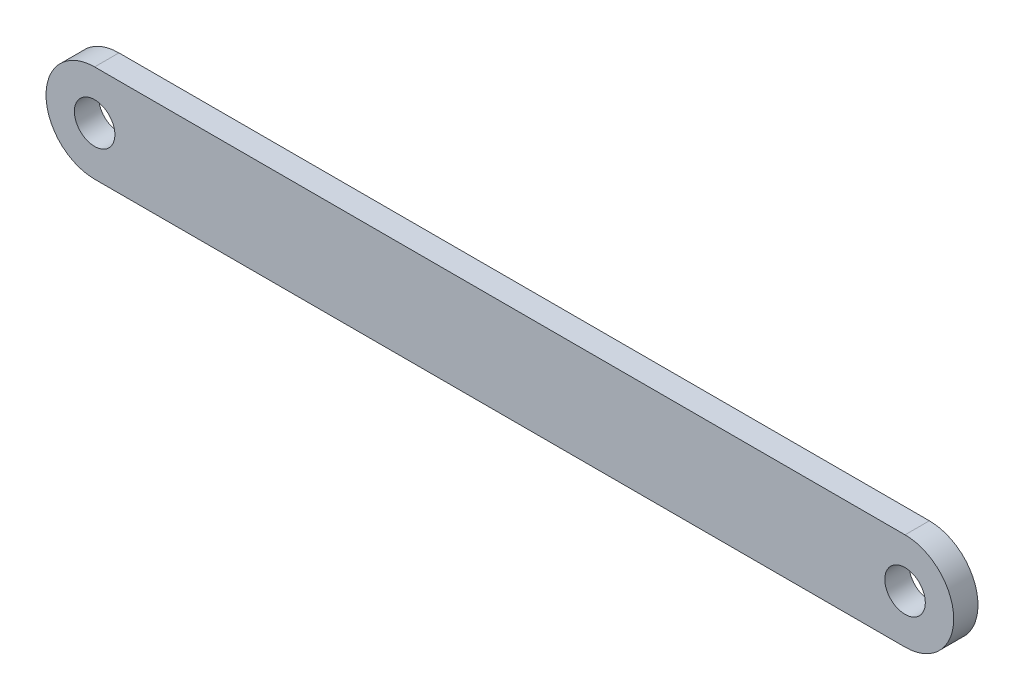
from build123d import *

# Parameters (mm, degrees)
CROQUIS1_R              = 2.5
SALIENTE_EXTRUIR1_DEPTH = 1.5


with BuildPart() as part:
    # Croquis1 → Saliente-Extruir1 (new, symmetric)
    with BuildSketch(Plane.XY):
        with BuildLine():
            Line((-50, 6), (50, 6))
            ThreePointArc((50, 6), (56, 0), (50, -6))
            Line((50, -6), (-50, -6))
            ThreePointArc((-50, -6), (-56, 0), (-50, 6))
        make_face()
        with Locations((50, 0)):
            Circle(CROQUIS1_R, mode=Mode.SUBTRACT)
        with Locations((-50, 0)):
            Circle(CROQUIS1_R, mode=Mode.SUBTRACT)
    extrude(amount=SALIENTE_EXTRUIR1_DEPTH, both=True)


solid = part.part
